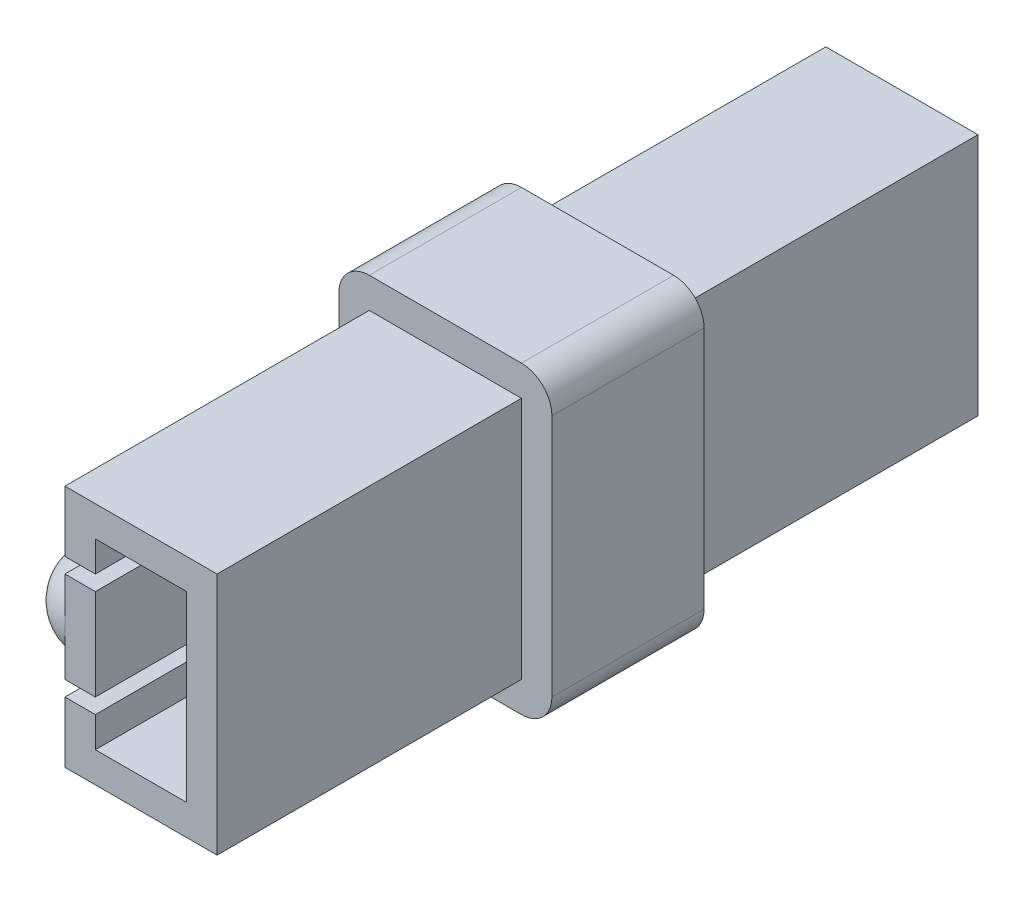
from build123d import *

# Parameters (mm, degrees)
SKETCH1_W          = 7
SKETCH1_H          = 10
EXTRUDE1_DEPTH     = 2.5
SKETCH2_W          = 5
SKETCH2_H          = 8
EXTRUDE2_DEPTH     = 12.5
FILLET1_R          = 1
CUT_EXTRUDE1_DEPTH = 1
REVOLVE1_ANGLE     = 180
SKETCH4_W          = 3
SKETCH4_H          = 6
CUT_EXTRUDE2_DEPTH = 12.5


with BuildPart() as part:
    # Sketch1 → Extrude1 (new, symmetric)
    with BuildSketch(Plane.XY):
        Rectangle(SKETCH1_W, SKETCH1_H)
    extrude(amount=EXTRUDE1_DEPTH, both=True)

    # Sketch2 → Extrude2 (add, symmetric)
    with BuildSketch(Plane.XY):
        Rectangle(SKETCH2_W, SKETCH2_H)
    extrude(amount=EXTRUDE2_DEPTH, both=True)

    # Fillet1
    fillet1_edges = [part.edges().sort_by_distance(p)[0] for p in [
        (3.5, -5, 0),
        (-3.5, -5, 0),
        (3.5, 5, 0),
        (-3.5, 5, 0),
    ]]
    fillet(fillet1_edges, radius=FILLET1_R)

    # Sketch3 → Cut-Extrude1 (cut)
    with BuildSketch(Plane.ZY.offset(2.5)):
        Polygon((-13.5, 2), (-2.5, 2), (-2.5, 1.5), (-12.5, 1.5), (-12.5, -1.5), (-2.5, -1.5), (-2.5, -2), (-13.5, -2), align=None)
        Polygon((2.5, -1.5), (2.5, -2), (13.5, -2), (13.5, 2), (2.5, 2), (2.5, 1.5), (12.5, 1.5), (12.5, -1.5), align=None)
    extrude(amount=-CUT_EXTRUDE1_DEPTH, mode=Mode.SUBTRACT)

    # Sketch5 → Revolve1 (revolve)
    with BuildSketch(Plane.ZY.offset(2.5)):
        with BuildLine():
            Line((9.5, 0), (12.5, 0))
            ThreePointArc((12.5, 0), (11, 1.5), (9.5, 0))
        make_face()
        with BuildLine():
            Line((-12.5, 0), (-9.5, 0))
            ThreePointArc((-9.5, 0), (-11, 1.5), (-12.5, 0))
        make_face()
    revolve(axis=Axis((-2.5, 0, -12.5), (0, 0, 1)), revolution_arc=REVOLVE1_ANGLE)

    # Sketch4 → Cut-Extrude2 (cut, symmetric)
    with BuildSketch(Plane.XY):
        Rectangle(SKETCH4_W, SKETCH4_H)
    extrude(amount=CUT_EXTRUDE2_DEPTH, both=True, mode=Mode.SUBTRACT)


solid = part.part
